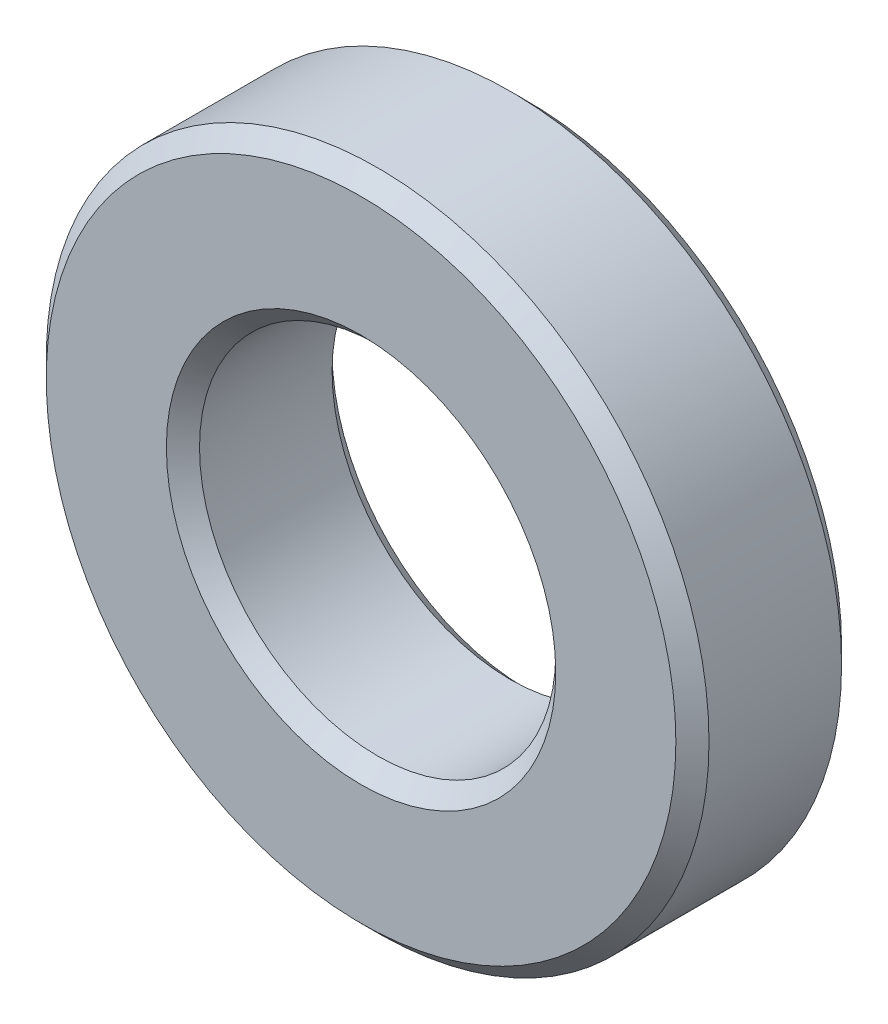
from build123d import *

# Parameters (mm, degrees)
SKETCH1_R           = 4
SKETCH1_R_2         = 2.15
BOSS_EXTRUDE2_DEPTH = 1
CHAMFER3_SIZE       = 0.2


with BuildPart() as part:
    # Sketch1 → Boss-Extrude2 (new, symmetric)
    with BuildSketch(Plane.XY):
        Circle(SKETCH1_R)
        Circle(SKETCH1_R_2, mode=Mode.SUBTRACT)
    extrude(amount=BOSS_EXTRUDE2_DEPTH, both=True)

    # Chamfer3
    chamfer3_edges = [part.edges().sort_by_distance(p)[0] for p in [
        (-4, 0, -1),
        (-4, 0, 1),
        (-2.15, 0, -1),
        (-2.15, 0, 1),
    ]]
    chamfer(chamfer3_edges, length=CHAMFER3_SIZE)


solid = part.part
